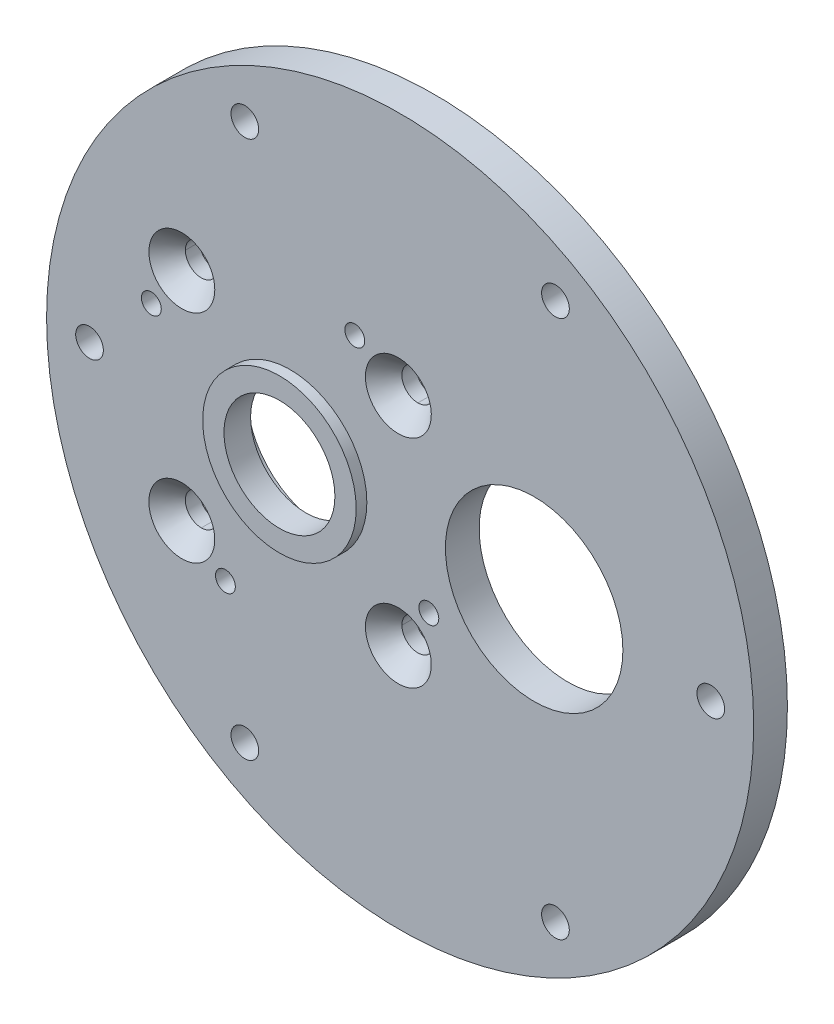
from build123d import *

# Parameters (mm, degrees)
SKETCH1_R           = 50.5968
BASE_EXTRUDE_DEPTH  = 4.826
SKETCH2_R           = 10.9855
BOSS_EXTRUDE1_DEPTH = 1.524
SKETCH3_R           = 7.9375
CUT_EXTRUDE1_DEPTH  = 84.677901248
SKETCH10_R          = 2.286
CUT_EXTRUDE3_DEPTH  = 84.576066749
SKETCH11_R          = 1.9812
CUT_EXTRUDE4_DEPTH  = 84.576066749
CIRPATTERN1_COUNT   = 6
SKETCH12_R          = 12.7
OIL_FEED_THRU_DEPTH = 84.576066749
SKETCH13_R          = 10.9982
CUT_EXTRUDE6_DEPTH  = 2.54
SKETCH15_R          = 1.4224
CUT_EXTRUDE7_DEPTH  = 84.576066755
CIRPATTERN4_COUNT   = 4
CIRPATTERN5_COUNT   = 4


with BuildPart() as part:
    # Sketch1 → Base-Extrude (new body)
    with BuildSketch(Plane.XY):
        with Locations((15.748, 0)):
            Circle(SKETCH1_R)
    extrude(amount=BASE_EXTRUDE_DEPTH)

    # Sketch2 → Boss-Extrude1 (add)
    with BuildSketch(Plane.XY.offset(4.826)):
        Circle(SKETCH2_R)
    extrude(amount=BOSS_EXTRUDE1_DEPTH)

    # Sketch3 → Cut-Extrude1 (cut, through all)
    with BuildSketch(Plane.XY.offset(6.35)):
        Circle(SKETCH3_R)
    extrude(amount=-CUT_EXTRUDE1_DEPTH, mode=Mode.SUBTRACT)

    # Sketch10 → Cut-Extrude3 (cut, through all)
    with BuildSketch(Plane.XY.offset(4.826)):
        with Locations((-15.490941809, -15.490941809)):
            Circle(SKETCH10_R)
        with Locations((-15.490941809, 15.490941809)):
            Circle(SKETCH10_R)
        with Locations((15.490941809, -15.490941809)):
            Circle(SKETCH10_R)
        with Locations((15.490941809, 15.490941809)):
            Circle(SKETCH10_R)
    extrude(amount=-CUT_EXTRUDE3_DEPTH, mode=Mode.SUBTRACT)

    # Sketch11 → Cut-Extrude4 (cut, through all)
    with BuildSketch(Plane.XY.offset(4.826)):
        with Locations((60.198, 0)):
            Circle(SKETCH11_R)
    cut_extrude4 = extrude(amount=-CUT_EXTRUDE4_DEPTH, mode=Mode.SUBTRACT)

    # CirPattern1: Cut-Extrude4 ×6 about axis
    cirpattern1_axis = Axis((15.748, 0, 54.826), (0, 0, -1))
    for i in range(1, CIRPATTERN1_COUNT):
        add(cut_extrude4.rotate(cirpattern1_axis, i * 360 / CIRPATTERN1_COUNT), mode=Mode.SUBTRACT)

    # Sketch12 → Oil Feed Thru (cut, through all)
    with BuildSketch(Plane.XY.offset(4.826)):
        with Locations((34.925, 0)):
            Circle(SKETCH12_R)
    extrude(amount=-OIL_FEED_THRU_DEPTH, mode=Mode.SUBTRACT)

    # Sketch13 → Cut-Extrude6 (cut)
    with BuildSketch(Plane(origin=(0, 0, 0), x_dir=(-1, 0, 0), z_dir=(0, 0, -1))):
        Circle(SKETCH13_R)
    extrude(amount=-CUT_EXTRUDE6_DEPTH, mode=Mode.SUBTRACT)

    # Sketch14 → Cut-Revolve1 (revolve, cut)
    with BuildSketch(Plane(origin=(0, 15.494, 0), x_dir=(-1, 0, 0), z_dir=(0, 1, 0)), mode=Mode.PRIVATE) as cut_revolve1_sk:
        Polygon((17.776941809, 0), (17.776941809, 2.032), (20.205728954, 4.826), (15.490941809, 4.826), (15.490941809, 0), align=None)
    cut_revolve1 = revolve(cut_revolve1_sk.sketch.rotate(Axis((-15.490941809, 15.494, 4.826), (0, 0, -1)), 180), axis=Axis((-15.490941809, 15.494, 4.826), (0, 0, -1)), mode=Mode.SUBTRACT)

    # Sketch15 → Cut-Extrude7 (cut, through all)
    with BuildSketch(Plane.XY.offset(4.826)):
        with Locations((19.854937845, -9.258509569)):
            Circle(SKETCH15_R)
    cut_extrude7 = extrude(amount=-CUT_EXTRUDE7_DEPTH, mode=Mode.SUBTRACT)

    # CirPattern4: Cut-Revolve1 ×4 about axis
    cirpattern4_axis = Axis((0, 0, -50), (0, 0, 1))
    for i in range(1, CIRPATTERN4_COUNT):
        add(cut_revolve1.rotate(cirpattern4_axis, i * 360 / CIRPATTERN4_COUNT), mode=Mode.SUBTRACT)

    # CirPattern5: Cut-Extrude7 ×4 about axis
    cirpattern5_axis = Axis((0, 0, -50), (0, 0, 1))
    for i in range(1, CIRPATTERN5_COUNT):
        add(cut_extrude7.rotate(cirpattern5_axis, i * 360 / CIRPATTERN5_COUNT), mode=Mode.SUBTRACT)


solid = part.part
